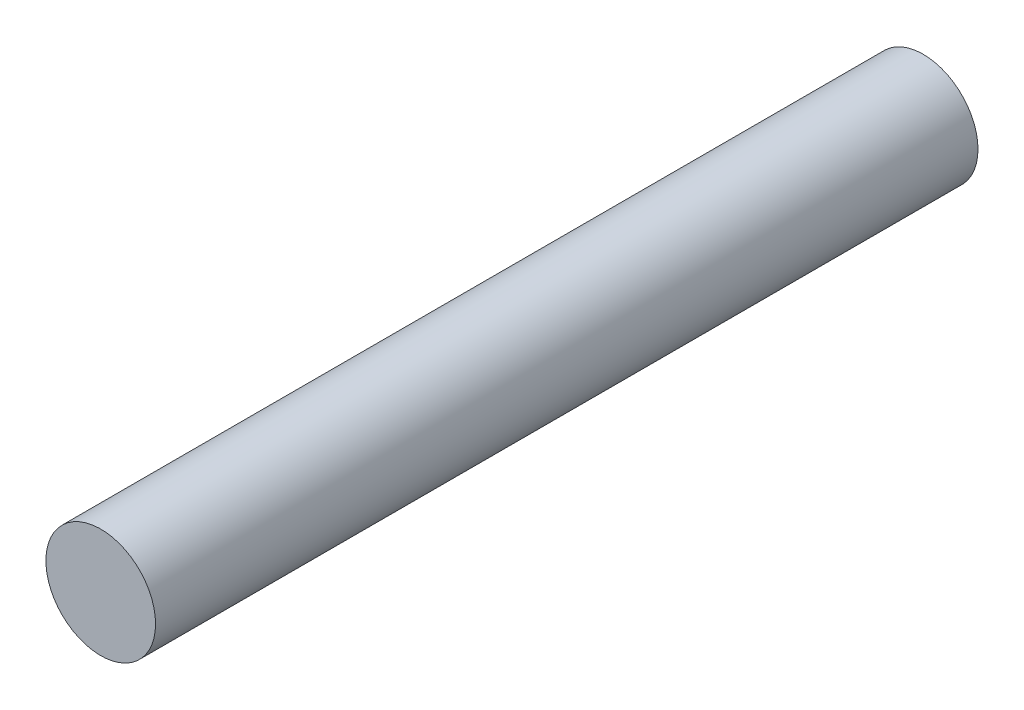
from build123d import *

# Parameters (mm, degrees)
SKETCH1_R           = 4
BOSS_EXTRUDE1_DEPTH = 30


with BuildPart() as part:
    # Sketch1 → Boss-Extrude1 (new, symmetric)
    with BuildSketch(Plane.XY):
        Circle(SKETCH1_R)
    extrude(amount=BOSS_EXTRUDE1_DEPTH, both=True)


solid = part.part
